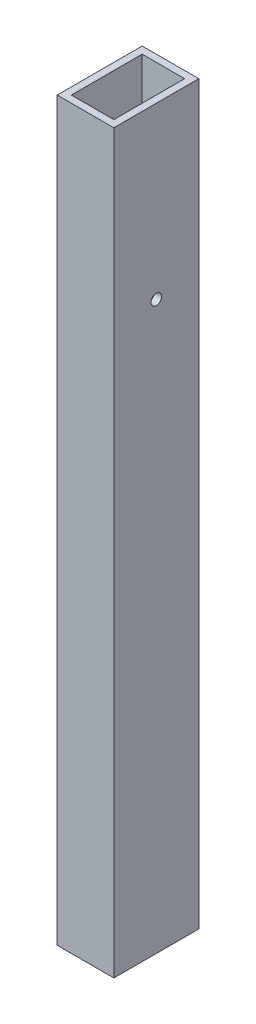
from build123d import *

# Parameters (mm, degrees)
SKETCH1_W          = 50.8
SKETCH1_H          = 76.2
SKETCH1_W_2        = 38.1
SKETCH1_H_2        = 63.5
EXTRUDE1_DEPTH     = 660.4
SKETCH2_R          = 4.7625
CUT_EXTRUDE1_DEPTH = 457.2


with BuildPart() as part:
    # Sketch1 → Extrude1 (new body)
    with BuildSketch(Plane(origin=(0, 0, 0), x_dir=(1, 0, 0), z_dir=(0, 1, 0))):
        Rectangle(SKETCH1_W, SKETCH1_H)
        Rectangle(SKETCH1_W_2, SKETCH1_H_2, mode=Mode.SUBTRACT)
    extrude(amount=-EXTRUDE1_DEPTH)

    # Sketch2 → Cut-Extrude1 (cut)
    with BuildSketch(Plane(origin=(25.4, 0, 0), x_dir=(0, 0, -1), z_dir=(1, 0, 0))):
        with Locations((0, -152.4)):
            Circle(SKETCH2_R)
    extrude(amount=-CUT_EXTRUDE1_DEPTH, mode=Mode.SUBTRACT)


solid = part.part
